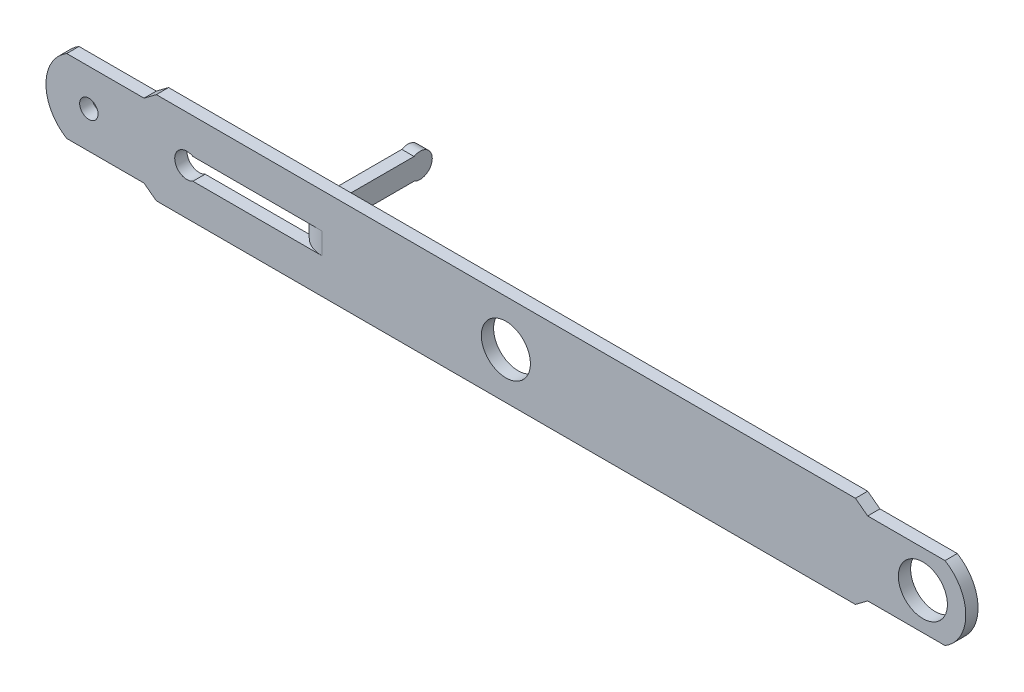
ISO-10303-21;
HEADER;
FILE_DESCRIPTION(('STEP AP214'),'2;1');
FILE_NAME('part.step','',(''),(''),'','','');
FILE_SCHEMA(('AUTOMOTIVE_DESIGN { 1 0 10303 214 1 1 1 1 }'));
ENDSEC;
DATA;
#1=APPLICATION_CONTEXT('core data for automotive mechanical design processes');
#2=APPLICATION_PROTOCOL_DEFINITION('international standard','automotive_design',2000,#1);
#3=PRODUCT_CONTEXT('',#1,'mechanical');
#4=PRODUCT('Part','Part','',(#3));
#5=PRODUCT_RELATED_PRODUCT_CATEGORY('part','',(#4));
#6=PRODUCT_DEFINITION_FORMATION('','',#4);
#7=PRODUCT_DEFINITION_CONTEXT('part definition',#1,'design');
#8=PRODUCT_DEFINITION('design','',#6,#7);
#9=PRODUCT_DEFINITION_SHAPE('','',#8);
#10=(LENGTH_UNIT() NAMED_UNIT(*) SI_UNIT(.MILLI.,.METRE.));
#11=(NAMED_UNIT(*) PLANE_ANGLE_UNIT() SI_UNIT($,.RADIAN.));
#12=(NAMED_UNIT(*) SI_UNIT($,.STERADIAN.) SOLID_ANGLE_UNIT());
#13=UNCERTAINTY_MEASURE_WITH_UNIT(LENGTH_MEASURE(1.E-05),#10,'distance_accuracy_value','');
#14=(GEOMETRIC_REPRESENTATION_CONTEXT(3) GLOBAL_UNCERTAINTY_ASSIGNED_CONTEXT((#13)) GLOBAL_UNIT_ASSIGNED_CONTEXT((#10,
#11,#12)) REPRESENTATION_CONTEXT('',''));
#15=CARTESIAN_POINT('',(0.,0.,0.));
#16=DIRECTION('',(0.,0.,1.));
#17=DIRECTION('',(1.,0.,0.));
#18=AXIS2_PLACEMENT_3D('',#15,#16,#17);
#19=CARTESIAN_POINT('',(-68.,0.,2.));
#20=DIRECTION('',(0.,0.,-1.));
#21=DIRECTION('',(-1.,0.,0.));
#22=AXIS2_PLACEMENT_3D('',#19,#20,#21);
#23=PLANE('',#22);
#24=DIRECTION('',(0.,-1.,0.));
#25=VECTOR('',#24,1.);
#26=CARTESIAN_POINT('',(-30.,0.,2.));
#27=LINE('',#26,#25);
#28=CARTESIAN_POINT('',(-30.,1.75,2.));
#29=VERTEX_POINT('',#28);
#30=CARTESIAN_POINT('',(-30.,-1.75,2.));
#31=VERTEX_POINT('',#30);
#32=EDGE_CURVE('E347',#29,#31,#27,.T.);
#33=ORIENTED_EDGE('',*,*,#32,.T.);
#34=DIRECTION('',(-1.,0.,0.));
#35=VECTOR('',#34,1.);
#36=CARTESIAN_POINT('',(-35.,-1.75,2.));
#37=LINE('',#36,#35);
#38=CARTESIAN_POINT('',(-51.0317541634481,-1.75,2.));
#39=VERTEX_POINT('',#38);
#40=EDGE_CURVE('E218',#31,#39,#37,.T.);
#41=ORIENTED_EDGE('',*,*,#40,.T.);
#42=CARTESIAN_POINT('',(-52.,0.,2.));
#43=DIRECTION('',(0.,0.,-1.));
#44=DIRECTION('',(-1.,0.,0.));
#45=AXIS2_PLACEMENT_3D('',#42,#43,#44);
#46=CIRCLE('',#45,2.);
#47=CARTESIAN_POINT('',(-51.0317541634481,1.75,2.));
#48=VERTEX_POINT('',#47);
#49=EDGE_CURVE('E221',#39,#48,#46,.T.);
#50=ORIENTED_EDGE('',*,*,#49,.T.);
#51=DIRECTION('',(1.,0.,0.));
#52=VECTOR('',#51,1.);
#53=CARTESIAN_POINT('',(-35.,1.75,2.));
#54=LINE('',#53,#52);
#55=EDGE_CURVE('E224',#48,#29,#54,.T.);
#56=ORIENTED_EDGE('',*,*,#55,.T.);
#57=EDGE_LOOP('',(#33,#41,#50,#56));
#58=FACE_BOUND('',#57,.T.);
#59=CARTESIAN_POINT('',(-68.,0.,2.));
#60=DIRECTION('',(0.,0.,1.));
#61=DIRECTION('',(1.,0.,0.));
#62=AXIS2_PLACEMENT_3D('',#59,#60,#61);
#63=CIRCLE('',#62,1.5);
#64=CARTESIAN_POINT('',(-66.5,0.,2.));
#65=VERTEX_POINT('',#64);
#66=EDGE_CURVE('E240',#65,#65,#63,.T.);
#67=ORIENTED_EDGE('',*,*,#66,.F.);
#68=EDGE_LOOP('',(#67));
#69=FACE_BOUND('',#68,.T.);
#70=DIRECTION('',(-1.,0.,0.));
#71=VECTOR('',#70,1.);
#72=CARTESIAN_POINT('',(57.,7.49999999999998,2.));
#73=LINE('',#72,#71);
#74=CARTESIAN_POINT('',(57.,7.49999999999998,2.));
#75=VERTEX_POINT('',#74);
#76=CARTESIAN_POINT('',(-57.,7.49999999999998,2.));
#77=VERTEX_POINT('',#76);
#78=EDGE_CURVE('E276',#75,#77,#73,.T.);
#79=ORIENTED_EDGE('',*,*,#78,.T.);
#80=DIRECTION('',(-0.800000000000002,-0.599999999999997,0.));
#81=VECTOR('',#80,1.);
#82=CARTESIAN_POINT('',(-59.,6.,2.));
#83=LINE('',#82,#81);
#84=CARTESIAN_POINT('',(-59.,6.,2.));
#85=VERTEX_POINT('',#84);
#86=EDGE_CURVE('E279',#77,#85,#83,.T.);
#87=ORIENTED_EDGE('',*,*,#86,.T.);
#88=DIRECTION('',(-1.,0.,0.));
#89=VECTOR('',#88,1.);
#90=CARTESIAN_POINT('',(-71.605551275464,5.99999999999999,2.));
#91=LINE('',#90,#89);
#92=CARTESIAN_POINT('',(-71.605551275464,5.99999999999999,2.));
#93=VERTEX_POINT('',#92);
#94=EDGE_CURVE('E281',#85,#93,#91,.T.);
#95=ORIENTED_EDGE('',*,*,#94,.T.);
#96=CARTESIAN_POINT('',(-68.,0.,2.));
#97=DIRECTION('',(0.,0.,1.));
#98=DIRECTION('',(-1.,0.,0.));
#99=AXIS2_PLACEMENT_3D('',#96,#97,#98);
#100=CIRCLE('',#99,7.);
#101=CARTESIAN_POINT('',(-71.605551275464,-5.99999999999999,2.));
#102=VERTEX_POINT('',#101);
#103=EDGE_CURVE('E283',#93,#102,#100,.T.);
#104=ORIENTED_EDGE('',*,*,#103,.T.);
#105=DIRECTION('',(1.,0.,0.));
#106=VECTOR('',#105,1.);
#107=CARTESIAN_POINT('',(-71.605551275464,-5.99999999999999,2.));
#108=LINE('',#107,#106);
#109=CARTESIAN_POINT('',(-59.,-6.,2.));
#110=VERTEX_POINT('',#109);
#111=EDGE_CURVE('E285',#102,#110,#108,.T.);
#112=ORIENTED_EDGE('',*,*,#111,.T.);
#113=DIRECTION('',(0.800000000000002,-0.599999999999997,0.));
#114=VECTOR('',#113,1.);
#115=CARTESIAN_POINT('',(-59.,-6.,2.));
#116=LINE('',#115,#114);
#117=CARTESIAN_POINT('',(-57.,-7.49999999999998,2.));
#118=VERTEX_POINT('',#117);
#119=EDGE_CURVE('E287',#110,#118,#116,.T.);
#120=ORIENTED_EDGE('',*,*,#119,.T.);
#121=DIRECTION('',(1.,0.,0.));
#122=VECTOR('',#121,1.);
#123=CARTESIAN_POINT('',(57.,-7.49999999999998,2.));
#124=LINE('',#123,#122);
#125=CARTESIAN_POINT('',(57.,-7.49999999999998,2.));
#126=VERTEX_POINT('',#125);
#127=EDGE_CURVE('E289',#118,#126,#124,.T.);
#128=ORIENTED_EDGE('',*,*,#127,.T.);
#129=DIRECTION('',(0.800000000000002,0.599999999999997,0.));
#130=VECTOR('',#129,1.);
#131=CARTESIAN_POINT('',(59.,-6.,2.));
#132=LINE('',#131,#130);
#133=CARTESIAN_POINT('',(59.,-6.,2.));
#134=VERTEX_POINT('',#133);
#135=EDGE_CURVE('E291',#126,#134,#132,.T.);
#136=ORIENTED_EDGE('',*,*,#135,.T.);
#137=DIRECTION('',(1.,0.,0.));
#138=VECTOR('',#137,1.);
#139=CARTESIAN_POINT('',(71.605551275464,-5.99999999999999,2.));
#140=LINE('',#139,#138);
#141=CARTESIAN_POINT('',(71.605551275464,-6.,2.));
#142=VERTEX_POINT('',#141);
#143=EDGE_CURVE('E293',#134,#142,#140,.T.);
#144=ORIENTED_EDGE('',*,*,#143,.T.);
#145=CARTESIAN_POINT('',(68.,0.,2.));
#146=DIRECTION('',(0.,0.,1.));
#147=DIRECTION('',(1.,0.,0.));
#148=AXIS2_PLACEMENT_3D('',#145,#146,#147);
#149=CIRCLE('',#148,7.);
#150=CARTESIAN_POINT('',(71.605551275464,5.99999999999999,2.));
#151=VERTEX_POINT('',#150);
#152=EDGE_CURVE('E295',#142,#151,#149,.T.);
#153=ORIENTED_EDGE('',*,*,#152,.T.);
#154=DIRECTION('',(-1.,0.,0.));
#155=VECTOR('',#154,1.);
#156=CARTESIAN_POINT('',(71.605551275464,5.99999999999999,2.));
#157=LINE('',#156,#155);
#158=CARTESIAN_POINT('',(59.,6.,2.));
#159=VERTEX_POINT('',#158);
#160=EDGE_CURVE('E297',#151,#159,#157,.T.);
#161=ORIENTED_EDGE('',*,*,#160,.T.);
#162=DIRECTION('',(-0.800000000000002,0.599999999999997,0.));
#163=VECTOR('',#162,1.);
#164=CARTESIAN_POINT('',(59.,6.,2.));
#165=LINE('',#164,#163);
#166=EDGE_CURVE('E299',#159,#75,#165,.T.);
#167=ORIENTED_EDGE('',*,*,#166,.T.);
#168=EDGE_LOOP('',(#79,#87,#95,#104,#112,#120,#128,#136,#144,#153,#161,#167));
#169=FACE_BOUND('',#168,.T.);
#170=CARTESIAN_POINT('',(68.,0.,2.));
#171=DIRECTION('',(0.,0.,1.));
#172=DIRECTION('',(1.,0.,0.));
#173=AXIS2_PLACEMENT_3D('',#170,#171,#172);
#174=CIRCLE('',#173,4.00000000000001);
#175=CARTESIAN_POINT('',(72.,0.,2.));
#176=VERTEX_POINT('',#175);
#177=EDGE_CURVE('E247',#176,#176,#174,.T.);
#178=ORIENTED_EDGE('',*,*,#177,.F.);
#179=EDGE_LOOP('',(#178));
#180=FACE_BOUND('',#179,.T.);
#181=CARTESIAN_POINT('',(0.,0.,2.));
#182=DIRECTION('',(0.,0.,1.));
#183=DIRECTION('',(1.,0.,0.));
#184=AXIS2_PLACEMENT_3D('',#181,#182,#183);
#185=CIRCLE('',#184,4.);
#186=CARTESIAN_POINT('',(4.,0.,2.));
#187=VERTEX_POINT('',#186);
#188=EDGE_CURVE('E234',#187,#187,#185,.T.);
#189=ORIENTED_EDGE('',*,*,#188,.F.);
#190=EDGE_LOOP('',(#189));
#191=FACE_BOUND('',#190,.T.);
#192=ADVANCED_FACE('F33',(#58,#69,#169,#180,#191),#23,.F.);
#193=CARTESIAN_POINT('',(-68.,0.,0.));
#194=DIRECTION('',(0.,0.,-1.));
#195=DIRECTION('',(-1.,0.,0.));
#196=AXIS2_PLACEMENT_3D('',#193,#194,#195);
#197=PLANE('',#196);
#198=DIRECTION('',(0.,1.,0.));
#199=VECTOR('',#198,1.);
#200=CARTESIAN_POINT('',(-30.,0.,0.));
#201=LINE('',#200,#199);
#202=CARTESIAN_POINT('',(-30.,-1.75,0.));
#203=VERTEX_POINT('',#202);
#204=CARTESIAN_POINT('',(-30.,1.75,0.));
#205=VERTEX_POINT('',#204);
#206=EDGE_CURVE('E337',#203,#205,#201,.T.);
#207=ORIENTED_EDGE('',*,*,#206,.T.);
#208=DIRECTION('',(1.,0.,0.));
#209=VECTOR('',#208,1.);
#210=CARTESIAN_POINT('',(-68.,1.75,0.));
#211=LINE('',#210,#209);
#212=CARTESIAN_POINT('',(-34.,1.75,0.));
#213=VERTEX_POINT('',#212);
#214=EDGE_CURVE('E207',#213,#205,#211,.T.);
#215=ORIENTED_EDGE('',*,*,#214,.F.);
#216=DIRECTION('',(1.,0.,0.));
#217=VECTOR('',#216,1.);
#218=CARTESIAN_POINT('',(-35.,1.75,0.));
#219=LINE('',#218,#217);
#220=CARTESIAN_POINT('',(-51.0317541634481,1.75,0.));
#221=VERTEX_POINT('',#220);
#222=EDGE_CURVE('E216',#221,#213,#219,.T.);
#223=ORIENTED_EDGE('',*,*,#222,.F.);
#224=CARTESIAN_POINT('',(-52.,0.,0.));
#225=DIRECTION('',(0.,0.,-1.));
#226=DIRECTION('',(-1.,0.,0.));
#227=AXIS2_PLACEMENT_3D('',#224,#225,#226);
#228=CIRCLE('',#227,2.);
#229=CARTESIAN_POINT('',(-51.0317541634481,-1.75,0.));
#230=VERTEX_POINT('',#229);
#231=EDGE_CURVE('E213',#230,#221,#228,.T.);
#232=ORIENTED_EDGE('',*,*,#231,.F.);
#233=DIRECTION('',(-1.,0.,0.));
#234=VECTOR('',#233,1.);
#235=CARTESIAN_POINT('',(-35.,-1.75,0.));
#236=LINE('',#235,#234);
#237=CARTESIAN_POINT('',(-34.,-1.75,0.));
#238=VERTEX_POINT('',#237);
#239=EDGE_CURVE('E48',#238,#230,#236,.T.);
#240=ORIENTED_EDGE('',*,*,#239,.F.);
#241=DIRECTION('',(-1.,0.,0.));
#242=VECTOR('',#241,1.);
#243=CARTESIAN_POINT('',(-68.,-1.75,0.));
#244=LINE('',#243,#242);
#245=EDGE_CURVE('E210',#203,#238,#244,.T.);
#246=ORIENTED_EDGE('',*,*,#245,.F.);
#247=EDGE_LOOP('',(#207,#215,#223,#232,#240,#246));
#248=FACE_BOUND('',#247,.T.);
#249=CARTESIAN_POINT('',(-68.,0.,0.));
#250=DIRECTION('',(0.,0.,1.));
#251=DIRECTION('',(1.,0.,0.));
#252=AXIS2_PLACEMENT_3D('',#249,#250,#251);
#253=CIRCLE('',#252,1.5);
#254=CARTESIAN_POINT('',(-66.5,0.,0.));
#255=VERTEX_POINT('',#254);
#256=EDGE_CURVE('E237',#255,#255,#253,.T.);
#257=ORIENTED_EDGE('',*,*,#256,.T.);
#258=EDGE_LOOP('',(#257));
#259=FACE_BOUND('',#258,.T.);
#260=DIRECTION('',(-1.,0.,0.));
#261=VECTOR('',#260,1.);
#262=CARTESIAN_POINT('',(57.,7.49999999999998,0.));
#263=LINE('',#262,#261);
#264=CARTESIAN_POINT('',(57.,7.49999999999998,0.));
#265=VERTEX_POINT('',#264);
#266=CARTESIAN_POINT('',(-57.,7.49999999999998,0.));
#267=VERTEX_POINT('',#266);
#268=EDGE_CURVE('E251',#265,#267,#263,.T.);
#269=ORIENTED_EDGE('',*,*,#268,.F.);
#270=DIRECTION('',(-0.800000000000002,0.599999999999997,0.));
#271=VECTOR('',#270,1.);
#272=CARTESIAN_POINT('',(59.,6.,0.));
#273=LINE('',#272,#271);
#274=CARTESIAN_POINT('',(59.,6.,0.));
#275=VERTEX_POINT('',#274);
#276=EDGE_CURVE('E274',#275,#265,#273,.T.);
#277=ORIENTED_EDGE('',*,*,#276,.F.);
#278=DIRECTION('',(-1.,0.,0.));
#279=VECTOR('',#278,1.);
#280=CARTESIAN_POINT('',(71.605551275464,5.99999999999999,0.));
#281=LINE('',#280,#279);
#282=CARTESIAN_POINT('',(71.605551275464,5.99999999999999,0.));
#283=VERTEX_POINT('',#282);
#284=EDGE_CURVE('E272',#283,#275,#281,.T.);
#285=ORIENTED_EDGE('',*,*,#284,.F.);
#286=CARTESIAN_POINT('',(68.,0.,0.));
#287=DIRECTION('',(0.,0.,1.));
#288=DIRECTION('',(1.,0.,0.));
#289=AXIS2_PLACEMENT_3D('',#286,#287,#288);
#290=CIRCLE('',#289,7.);
#291=CARTESIAN_POINT('',(71.605551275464,-6.,0.));
#292=VERTEX_POINT('',#291);
#293=EDGE_CURVE('E270',#292,#283,#290,.T.);
#294=ORIENTED_EDGE('',*,*,#293,.F.);
#295=DIRECTION('',(1.,0.,0.));
#296=VECTOR('',#295,1.);
#297=CARTESIAN_POINT('',(71.605551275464,-5.99999999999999,0.));
#298=LINE('',#297,#296);
#299=CARTESIAN_POINT('',(59.,-6.,0.));
#300=VERTEX_POINT('',#299);
#301=EDGE_CURVE('E268',#300,#292,#298,.T.);
#302=ORIENTED_EDGE('',*,*,#301,.F.);
#303=DIRECTION('',(0.800000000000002,0.599999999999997,0.));
#304=VECTOR('',#303,1.);
#305=CARTESIAN_POINT('',(59.,-6.,0.));
#306=LINE('',#305,#304);
#307=CARTESIAN_POINT('',(57.,-7.49999999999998,0.));
#308=VERTEX_POINT('',#307);
#309=EDGE_CURVE('E266',#308,#300,#306,.T.);
#310=ORIENTED_EDGE('',*,*,#309,.F.);
#311=DIRECTION('',(1.,0.,0.));
#312=VECTOR('',#311,1.);
#313=CARTESIAN_POINT('',(57.,-7.49999999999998,0.));
#314=LINE('',#313,#312);
#315=CARTESIAN_POINT('',(-57.,-7.49999999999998,0.));
#316=VERTEX_POINT('',#315);
#317=EDGE_CURVE('E264',#316,#308,#314,.T.);
#318=ORIENTED_EDGE('',*,*,#317,.F.);
#319=DIRECTION('',(0.800000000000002,-0.599999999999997,0.));
#320=VECTOR('',#319,1.);
#321=CARTESIAN_POINT('',(-59.,-6.,0.));
#322=LINE('',#321,#320);
#323=CARTESIAN_POINT('',(-59.,-6.,0.));
#324=VERTEX_POINT('',#323);
#325=EDGE_CURVE('E262',#324,#316,#322,.T.);
#326=ORIENTED_EDGE('',*,*,#325,.F.);
#327=DIRECTION('',(1.,0.,0.));
#328=VECTOR('',#327,1.);
#329=CARTESIAN_POINT('',(-71.605551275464,-5.99999999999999,0.));
#330=LINE('',#329,#328);
#331=CARTESIAN_POINT('',(-71.605551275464,-5.99999999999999,0.));
#332=VERTEX_POINT('',#331);
#333=EDGE_CURVE('E260',#332,#324,#330,.T.);
#334=ORIENTED_EDGE('',*,*,#333,.F.);
#335=CARTESIAN_POINT('',(-68.,0.,0.));
#336=DIRECTION('',(0.,0.,1.));
#337=DIRECTION('',(-1.,0.,0.));
#338=AXIS2_PLACEMENT_3D('',#335,#336,#337);
#339=CIRCLE('',#338,7.);
#340=CARTESIAN_POINT('',(-71.605551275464,5.99999999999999,0.));
#341=VERTEX_POINT('',#340);
#342=EDGE_CURVE('E258',#341,#332,#339,.T.);
#343=ORIENTED_EDGE('',*,*,#342,.F.);
#344=DIRECTION('',(-1.,0.,0.));
#345=VECTOR('',#344,1.);
#346=CARTESIAN_POINT('',(-71.605551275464,5.99999999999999,0.));
#347=LINE('',#346,#345);
#348=CARTESIAN_POINT('',(-59.,6.,0.));
#349=VERTEX_POINT('',#348);
#350=EDGE_CURVE('E256',#349,#341,#347,.T.);
#351=ORIENTED_EDGE('',*,*,#350,.F.);
#352=DIRECTION('',(-0.800000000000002,-0.599999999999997,0.));
#353=VECTOR('',#352,1.);
#354=CARTESIAN_POINT('',(-59.,6.,0.));
#355=LINE('',#354,#353);
#356=EDGE_CURVE('E254',#267,#349,#355,.T.);
#357=ORIENTED_EDGE('',*,*,#356,.F.);
#358=EDGE_LOOP('',(#269,#277,#285,#294,#302,#310,#318,#326,#334,#343,#351,#357));
#359=FACE_BOUND('',#358,.T.);
#360=CARTESIAN_POINT('',(68.,0.,0.));
#361=DIRECTION('',(0.,0.,1.));
#362=DIRECTION('',(1.,0.,0.));
#363=AXIS2_PLACEMENT_3D('',#360,#361,#362);
#364=CIRCLE('',#363,4.00000000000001);
#365=CARTESIAN_POINT('',(72.,0.,0.));
#366=VERTEX_POINT('',#365);
#367=EDGE_CURVE('E243',#366,#366,#364,.T.);
#368=ORIENTED_EDGE('',*,*,#367,.T.);
#369=EDGE_LOOP('',(#368));
#370=FACE_BOUND('',#369,.T.);
#371=CARTESIAN_POINT('',(0.,0.,0.));
#372=DIRECTION('',(0.,0.,1.));
#373=DIRECTION('',(1.,0.,0.));
#374=AXIS2_PLACEMENT_3D('',#371,#372,#373);
#375=CIRCLE('',#374,4.);
#376=CARTESIAN_POINT('',(4.,0.,0.));
#377=VERTEX_POINT('',#376);
#378=EDGE_CURVE('E229',#377,#377,#375,.T.);
#379=ORIENTED_EDGE('',*,*,#378,.T.);
#380=EDGE_LOOP('',(#379));
#381=FACE_BOUND('',#380,.T.);
#382=ADVANCED_FACE('F367',(#248,#259,#359,#370,#381),#197,.T.);
#383=CARTESIAN_POINT('',(57.,7.49999999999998,2.));
#384=DIRECTION('',(0.,-1.,0.));
#385=DIRECTION('',(0.,0.,-1.));
#386=AXIS2_PLACEMENT_3D('',#383,#384,#385);
#387=PLANE('',#386);
#388=ORIENTED_EDGE('',*,*,#268,.T.);
#389=DIRECTION('',(0.,0.,-1.));
#390=VECTOR('',#389,1.);
#391=CARTESIAN_POINT('',(-57.,7.49999999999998,2.));
#392=LINE('',#391,#390);
#393=EDGE_CURVE('E334',#77,#267,#392,.T.);
#394=ORIENTED_EDGE('',*,*,#393,.F.);
#395=ORIENTED_EDGE('',*,*,#78,.F.);
#396=DIRECTION('',(0.,0.,-1.));
#397=VECTOR('',#396,1.);
#398=CARTESIAN_POINT('',(57.,7.49999999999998,2.));
#399=LINE('',#398,#397);
#400=EDGE_CURVE('E301',#75,#265,#399,.T.);
#401=ORIENTED_EDGE('',*,*,#400,.T.);
#402=EDGE_LOOP('',(#388,#394,#395,#401));
#403=FACE_BOUND('',#402,.T.);
#404=ADVANCED_FACE('F35',(#403),#387,.F.);
#405=CARTESIAN_POINT('',(-59.,6.,2.));
#406=DIRECTION('',(0.599999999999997,-0.800000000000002,0.));
#407=DIRECTION('',(0.800000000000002,0.599999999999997,0.));
#408=AXIS2_PLACEMENT_3D('',#405,#406,#407);
#409=PLANE('',#408);
#410=ORIENTED_EDGE('',*,*,#356,.T.);
#411=DIRECTION('',(0.,0.,-1.));
#412=VECTOR('',#411,1.);
#413=CARTESIAN_POINT('',(-59.,6.,2.));
#414=LINE('',#413,#412);
#415=EDGE_CURVE('E331',#85,#349,#414,.T.);
#416=ORIENTED_EDGE('',*,*,#415,.F.);
#417=ORIENTED_EDGE('',*,*,#86,.F.);
#418=ORIENTED_EDGE('',*,*,#393,.T.);
#419=EDGE_LOOP('',(#410,#416,#417,#418));
#420=FACE_BOUND('',#419,.T.);
#421=ADVANCED_FACE('F437',(#420),#409,.F.);
#422=CARTESIAN_POINT('',(-71.605551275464,5.99999999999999,2.));
#423=DIRECTION('',(0.,-1.,0.));
#424=DIRECTION('',(1.,0.,0.));
#425=AXIS2_PLACEMENT_3D('',#422,#423,#424);
#426=PLANE('',#425);
#427=ORIENTED_EDGE('',*,*,#350,.T.);
#428=DIRECTION('',(0.,0.,-1.));
#429=VECTOR('',#428,1.);
#430=CARTESIAN_POINT('',(-71.605551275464,5.99999999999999,2.));
#431=LINE('',#430,#429);
#432=EDGE_CURVE('E328',#93,#341,#431,.T.);
#433=ORIENTED_EDGE('',*,*,#432,.F.);
#434=ORIENTED_EDGE('',*,*,#94,.F.);
#435=ORIENTED_EDGE('',*,*,#415,.T.);
#436=EDGE_LOOP('',(#427,#433,#434,#435));
#437=FACE_BOUND('',#436,.T.);
#438=ADVANCED_FACE('F434',(#437),#426,.F.);
#439=CARTESIAN_POINT('',(-68.,0.,2.));
#440=DIRECTION('',(0.,0.,-1.));
#441=DIRECTION('',(-1.,0.,0.));
#442=AXIS2_PLACEMENT_3D('',#439,#440,#441);
#443=CYLINDRICAL_SURFACE('',#442,7.);
#444=ORIENTED_EDGE('',*,*,#342,.T.);
#445=DIRECTION('',(0.,0.,-1.));
#446=VECTOR('',#445,1.);
#447=CARTESIAN_POINT('',(-71.605551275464,-5.99999999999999,2.));
#448=LINE('',#447,#446);
#449=EDGE_CURVE('E325',#102,#332,#448,.T.);
#450=ORIENTED_EDGE('',*,*,#449,.F.);
#451=ORIENTED_EDGE('',*,*,#103,.F.);
#452=ORIENTED_EDGE('',*,*,#432,.T.);
#453=EDGE_LOOP('',(#444,#450,#451,#452));
#454=FACE_BOUND('',#453,.T.);
#455=ADVANCED_FACE('F430',(#454),#443,.T.);
#456=CARTESIAN_POINT('',(-71.605551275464,-5.99999999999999,2.));
#457=DIRECTION('',(0.,1.,0.));
#458=DIRECTION('',(-1.,0.,0.));
#459=AXIS2_PLACEMENT_3D('',#456,#457,#458);
#460=PLANE('',#459);
#461=ORIENTED_EDGE('',*,*,#333,.T.);
#462=DIRECTION('',(0.,0.,-1.));
#463=VECTOR('',#462,1.);
#464=CARTESIAN_POINT('',(-59.,-6.,2.));
#465=LINE('',#464,#463);
#466=EDGE_CURVE('E322',#110,#324,#465,.T.);
#467=ORIENTED_EDGE('',*,*,#466,.F.);
#468=ORIENTED_EDGE('',*,*,#111,.F.);
#469=ORIENTED_EDGE('',*,*,#449,.T.);
#470=EDGE_LOOP('',(#461,#467,#468,#469));
#471=FACE_BOUND('',#470,.T.);
#472=ADVANCED_FACE('F426',(#471),#460,.F.);
#473=CARTESIAN_POINT('',(-59.,-6.,2.));
#474=DIRECTION('',(0.599999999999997,0.800000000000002,0.));
#475=DIRECTION('',(-0.800000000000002,0.599999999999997,0.));
#476=AXIS2_PLACEMENT_3D('',#473,#474,#475);
#477=PLANE('',#476);
#478=ORIENTED_EDGE('',*,*,#325,.T.);
#479=DIRECTION('',(0.,0.,-1.));
#480=VECTOR('',#479,1.);
#481=CARTESIAN_POINT('',(-57.,-7.49999999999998,2.));
#482=LINE('',#481,#480);
#483=EDGE_CURVE('E319',#118,#316,#482,.T.);
#484=ORIENTED_EDGE('',*,*,#483,.F.);
#485=ORIENTED_EDGE('',*,*,#119,.F.);
#486=ORIENTED_EDGE('',*,*,#466,.T.);
#487=EDGE_LOOP('',(#478,#484,#485,#486));
#488=FACE_BOUND('',#487,.T.);
#489=ADVANCED_FACE('F422',(#488),#477,.F.);
#490=CARTESIAN_POINT('',(57.,-7.49999999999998,2.));
#491=DIRECTION('',(0.,1.,0.));
#492=DIRECTION('',(0.,0.,1.));
#493=AXIS2_PLACEMENT_3D('',#490,#491,#492);
#494=PLANE('',#493);
#495=ORIENTED_EDGE('',*,*,#317,.T.);
#496=DIRECTION('',(0.,0.,-1.));
#497=VECTOR('',#496,1.);
#498=CARTESIAN_POINT('',(57.,-7.49999999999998,2.));
#499=LINE('',#498,#497);
#500=EDGE_CURVE('E316',#126,#308,#499,.T.);
#501=ORIENTED_EDGE('',*,*,#500,.F.);
#502=ORIENTED_EDGE('',*,*,#127,.F.);
#503=ORIENTED_EDGE('',*,*,#483,.T.);
#504=EDGE_LOOP('',(#495,#501,#502,#503));
#505=FACE_BOUND('',#504,.T.);
#506=ADVANCED_FACE('F418',(#505),#494,.F.);
#507=CARTESIAN_POINT('',(59.,-6.,2.));
#508=DIRECTION('',(-0.599999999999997,0.800000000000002,0.));
#509=DIRECTION('',(-0.800000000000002,-0.599999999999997,0.));
#510=AXIS2_PLACEMENT_3D('',#507,#508,#509);
#511=PLANE('',#510);
#512=ORIENTED_EDGE('',*,*,#309,.T.);
#513=DIRECTION('',(0.,0.,-1.));
#514=VECTOR('',#513,1.);
#515=CARTESIAN_POINT('',(59.,-6.,2.));
#516=LINE('',#515,#514);
#517=EDGE_CURVE('E313',#134,#300,#516,.T.);
#518=ORIENTED_EDGE('',*,*,#517,.F.);
#519=ORIENTED_EDGE('',*,*,#135,.F.);
#520=ORIENTED_EDGE('',*,*,#500,.T.);
#521=EDGE_LOOP('',(#512,#518,#519,#520));
#522=FACE_BOUND('',#521,.T.);
#523=ADVANCED_FACE('F414',(#522),#511,.F.);
#524=CARTESIAN_POINT('',(71.605551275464,-5.99999999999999,2.));
#525=DIRECTION('',(0.,1.,0.));
#526=DIRECTION('',(-1.,0.,0.));
#527=AXIS2_PLACEMENT_3D('',#524,#525,#526);
#528=PLANE('',#527);
#529=ORIENTED_EDGE('',*,*,#301,.T.);
#530=DIRECTION('',(0.,0.,-1.));
#531=VECTOR('',#530,1.);
#532=CARTESIAN_POINT('',(71.605551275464,-6.,2.));
#533=LINE('',#532,#531);
#534=EDGE_CURVE('E310',#142,#292,#533,.T.);
#535=ORIENTED_EDGE('',*,*,#534,.F.);
#536=ORIENTED_EDGE('',*,*,#143,.F.);
#537=ORIENTED_EDGE('',*,*,#517,.T.);
#538=EDGE_LOOP('',(#529,#535,#536,#537));
#539=FACE_BOUND('',#538,.T.);
#540=ADVANCED_FACE('F410',(#539),#528,.F.);
#541=CARTESIAN_POINT('',(68.,0.,2.));
#542=DIRECTION('',(0.,0.,-1.));
#543=DIRECTION('',(-1.,0.,0.));
#544=AXIS2_PLACEMENT_3D('',#541,#542,#543);
#545=CYLINDRICAL_SURFACE('',#544,7.);
#546=ORIENTED_EDGE('',*,*,#293,.T.);
#547=DIRECTION('',(0.,0.,-1.));
#548=VECTOR('',#547,1.);
#549=CARTESIAN_POINT('',(71.605551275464,5.99999999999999,2.));
#550=LINE('',#549,#548);
#551=EDGE_CURVE('E307',#151,#283,#550,.T.);
#552=ORIENTED_EDGE('',*,*,#551,.F.);
#553=ORIENTED_EDGE('',*,*,#152,.F.);
#554=ORIENTED_EDGE('',*,*,#534,.T.);
#555=EDGE_LOOP('',(#546,#552,#553,#554));
#556=FACE_BOUND('',#555,.T.);
#557=ADVANCED_FACE('F406',(#556),#545,.T.);
#558=CARTESIAN_POINT('',(71.605551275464,5.99999999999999,2.));
#559=DIRECTION('',(0.,-1.,0.));
#560=DIRECTION('',(1.,0.,0.));
#561=AXIS2_PLACEMENT_3D('',#558,#559,#560);
#562=PLANE('',#561);
#563=ORIENTED_EDGE('',*,*,#284,.T.);
#564=DIRECTION('',(0.,0.,-1.));
#565=VECTOR('',#564,1.);
#566=CARTESIAN_POINT('',(59.,6.,2.));
#567=LINE('',#566,#565);
#568=EDGE_CURVE('E304',#159,#275,#567,.T.);
#569=ORIENTED_EDGE('',*,*,#568,.F.);
#570=ORIENTED_EDGE('',*,*,#160,.F.);
#571=ORIENTED_EDGE('',*,*,#551,.T.);
#572=EDGE_LOOP('',(#563,#569,#570,#571));
#573=FACE_BOUND('',#572,.T.);
#574=ADVANCED_FACE('F402',(#573),#562,.F.);
#575=CARTESIAN_POINT('',(59.,6.,2.));
#576=DIRECTION('',(-0.599999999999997,-0.800000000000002,0.));
#577=DIRECTION('',(0.800000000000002,-0.599999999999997,0.));
#578=AXIS2_PLACEMENT_3D('',#575,#576,#577);
#579=PLANE('',#578);
#580=ORIENTED_EDGE('',*,*,#276,.T.);
#581=ORIENTED_EDGE('',*,*,#400,.F.);
#582=ORIENTED_EDGE('',*,*,#166,.F.);
#583=ORIENTED_EDGE('',*,*,#568,.T.);
#584=EDGE_LOOP('',(#580,#581,#582,#583));
#585=FACE_BOUND('',#584,.T.);
#586=ADVANCED_FACE('F398',(#585),#579,.F.);
#587=CARTESIAN_POINT('',(68.,0.,2.));
#588=DIRECTION('',(0.,0.,-1.));
#589=DIRECTION('',(-1.,0.,0.));
#590=AXIS2_PLACEMENT_3D('',#587,#588,#589);
#591=CYLINDRICAL_SURFACE('',#590,4.00000000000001);
#592=ORIENTED_EDGE('',*,*,#177,.T.);
#593=EDGE_LOOP('',(#592));
#594=FACE_BOUND('',#593,.T.);
#595=ORIENTED_EDGE('',*,*,#367,.F.);
#596=EDGE_LOOP('',(#595));
#597=FACE_BOUND('',#596,.T.);
#598=ADVANCED_FACE('F401',(#594,#597),#591,.F.);
#599=CARTESIAN_POINT('',(-68.,0.,2.));
#600=DIRECTION('',(0.,0.,-1.));
#601=DIRECTION('',(-1.,0.,0.));
#602=AXIS2_PLACEMENT_3D('',#599,#600,#601);
#603=CYLINDRICAL_SURFACE('',#602,1.5);
#604=ORIENTED_EDGE('',*,*,#66,.T.);
#605=EDGE_LOOP('',(#604));
#606=FACE_BOUND('',#605,.T.);
#607=ORIENTED_EDGE('',*,*,#256,.F.);
#608=EDGE_LOOP('',(#607));
#609=FACE_BOUND('',#608,.T.);
#610=ADVANCED_FACE('F490',(#606,#609),#603,.F.);
#611=CARTESIAN_POINT('',(0.,0.,2.));
#612=DIRECTION('',(0.,0.,-1.));
#613=DIRECTION('',(-1.,0.,0.));
#614=AXIS2_PLACEMENT_3D('',#611,#612,#613);
#615=CYLINDRICAL_SURFACE('',#614,4.);
#616=ORIENTED_EDGE('',*,*,#188,.T.);
#617=EDGE_LOOP('',(#616));
#618=FACE_BOUND('',#617,.T.);
#619=ORIENTED_EDGE('',*,*,#378,.F.);
#620=EDGE_LOOP('',(#619));
#621=FACE_BOUND('',#620,.T.);
#622=ADVANCED_FACE('F487',(#618,#621),#615,.F.);
#623=CARTESIAN_POINT('',(-35.,1.75,2.));
#624=DIRECTION('',(1.,0.,0.));
#625=DIRECTION('',(0.,0.,-1.));
#626=AXIS2_PLACEMENT_3D('',#623,#624,#625);
#627=PLANE('',#626);
#628=DIRECTION('',(0.,0.,1.));
#629=VECTOR('',#628,1.);
#630=CARTESIAN_POINT('',(-35.,-1.75,2.));
#631=LINE('',#630,#629);
#632=CARTESIAN_POINT('',(-35.,-1.75,-16.0317541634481));
#633=VERTEX_POINT('',#632);
#634=CARTESIAN_POINT('',(-35.,-1.75,-3.));
#635=VERTEX_POINT('',#634);
#636=EDGE_CURVE('E198',#633,#635,#631,.T.);
#637=ORIENTED_EDGE('',*,*,#636,.T.);
#638=DIRECTION('',(0.,-1.,0.));
#639=VECTOR('',#638,1.);
#640=CARTESIAN_POINT('',(-35.,1.75,-3.));
#641=LINE('',#640,#639);
#642=CARTESIAN_POINT('',(-35.,1.75,-3.));
#643=VERTEX_POINT('',#642);
#644=EDGE_CURVE('E181',#635,#643,#641,.F.);
#645=ORIENTED_EDGE('',*,*,#644,.T.);
#646=DIRECTION('',(0.,0.,-1.));
#647=VECTOR('',#646,1.);
#648=CARTESIAN_POINT('',(-35.,1.75,2.));
#649=LINE('',#648,#647);
#650=CARTESIAN_POINT('',(-35.,1.75,-16.0317541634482));
#651=VERTEX_POINT('',#650);
#652=EDGE_CURVE('E173',#643,#651,#649,.T.);
#653=ORIENTED_EDGE('',*,*,#652,.T.);
#654=CARTESIAN_POINT('',(-35.,0.,-17.));
#655=DIRECTION('',(-1.,0.,0.));
#656=DIRECTION('',(0.,0.,1.));
#657=AXIS2_PLACEMENT_3D('',#654,#655,#656);
#658=CIRCLE('',#657,2.);
#659=EDGE_CURVE('E178',#651,#633,#658,.T.);
#660=ORIENTED_EDGE('',*,*,#659,.T.);
#661=EDGE_LOOP('',(#637,#645,#653,#660));
#662=FACE_BOUND('',#661,.T.);
#663=ADVANCED_FACE('F176',(#662),#627,.F.);
#664=CARTESIAN_POINT('',(-35.,1.75,2.));
#665=DIRECTION('',(0.,1.,0.));
#666=DIRECTION('',(0.,0.,1.));
#667=AXIS2_PLACEMENT_3D('',#664,#665,#666);
#668=PLANE('',#667);
#669=ORIENTED_EDGE('',*,*,#222,.T.);
#670=CARTESIAN_POINT('',(-30.,1.75,-3.));
#671=DIRECTION('',(0.,1.,0.));
#672=DIRECTION('',(0.,0.,1.));
#673=AXIS2_PLACEMENT_3D('',#670,#671,#672);
#674=CIRCLE('',#673,5.);
#675=EDGE_CURVE('E11',#213,#29,#674,.T.);
#676=ORIENTED_EDGE('',*,*,#675,.T.);
#677=ORIENTED_EDGE('',*,*,#55,.F.);
#678=DIRECTION('',(0.,0.,-1.));
#679=VECTOR('',#678,1.);
#680=CARTESIAN_POINT('',(-51.0317541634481,1.75,2.));
#681=LINE('',#680,#679);
#682=EDGE_CURVE('E227',#48,#221,#681,.T.);
#683=ORIENTED_EDGE('',*,*,#682,.T.);
#684=EDGE_LOOP('',(#669,#676,#677,#683));
#685=FACE_BOUND('',#684,.T.);
#686=ADVANCED_FACE('F498',(#685),#668,.F.);
#687=CARTESIAN_POINT('',(-52.,0.,2.));
#688=DIRECTION('',(0.,0.,-1.));
#689=DIRECTION('',(-1.,0.,0.));
#690=AXIS2_PLACEMENT_3D('',#687,#688,#689);
#691=CYLINDRICAL_SURFACE('',#690,2.);
#692=ORIENTED_EDGE('',*,*,#231,.T.);
#693=ORIENTED_EDGE('',*,*,#682,.F.);
#694=ORIENTED_EDGE('',*,*,#49,.F.);
#695=DIRECTION('',(0.,0.,-1.));
#696=VECTOR('',#695,1.);
#697=CARTESIAN_POINT('',(-51.0317541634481,-1.75,2.));
#698=LINE('',#697,#696);
#699=EDGE_CURVE('E226',#39,#230,#698,.T.);
#700=ORIENTED_EDGE('',*,*,#699,.T.);
#701=EDGE_LOOP('',(#692,#693,#694,#700));
#702=FACE_BOUND('',#701,.T.);
#703=ADVANCED_FACE('F534',(#702),#691,.F.);
#704=CARTESIAN_POINT('',(-35.,-1.75,2.));
#705=DIRECTION('',(0.,-1.,0.));
#706=DIRECTION('',(0.,0.,-1.));
#707=AXIS2_PLACEMENT_3D('',#704,#705,#706);
#708=PLANE('',#707);
#709=ORIENTED_EDGE('',*,*,#239,.T.);
#710=ORIENTED_EDGE('',*,*,#699,.F.);
#711=ORIENTED_EDGE('',*,*,#40,.F.);
#712=CARTESIAN_POINT('',(-30.,-1.75,-3.));
#713=DIRECTION('',(0.,-1.,0.));
#714=DIRECTION('',(0.,0.,-1.));
#715=AXIS2_PLACEMENT_3D('',#712,#713,#714);
#716=CIRCLE('',#715,5.);
#717=EDGE_CURVE('E42',#31,#238,#716,.T.);
#718=ORIENTED_EDGE('',*,*,#717,.T.);
#719=EDGE_LOOP('',(#709,#710,#711,#718));
#720=FACE_BOUND('',#719,.T.);
#721=ADVANCED_FACE('F358',(#720),#708,.F.);
#722=CARTESIAN_POINT('',(-33.,-1.75,2.));
#723=DIRECTION('',(0.,-1.,0.));
#724=DIRECTION('',(0.,0.,-1.));
#725=AXIS2_PLACEMENT_3D('',#722,#723,#724);
#726=PLANE('',#725);
#727=ORIENTED_EDGE('',*,*,#245,.T.);
#728=CARTESIAN_POINT('',(-30.,-1.75,-3.));
#729=DIRECTION('',(0.,-1.,0.));
#730=DIRECTION('',(0.,0.,-1.));
#731=AXIS2_PLACEMENT_3D('',#728,#729,#730);
#732=CIRCLE('',#731,5.);
#733=EDGE_CURVE('E350',#238,#635,#732,.T.);
#734=ORIENTED_EDGE('',*,*,#733,.T.);
#735=ORIENTED_EDGE('',*,*,#636,.F.);
#736=DIRECTION('',(-1.,0.,0.));
#737=VECTOR('',#736,1.);
#738=CARTESIAN_POINT('',(-33.,-1.75,-16.0317541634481));
#739=LINE('',#738,#737);
#740=CARTESIAN_POINT('',(-33.,-1.75,-16.0317541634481));
#741=VERTEX_POINT('',#740);
#742=EDGE_CURVE('E194',#741,#633,#739,.T.);
#743=ORIENTED_EDGE('',*,*,#742,.F.);
#744=DIRECTION('',(0.,0.,1.));
#745=VECTOR('',#744,1.);
#746=CARTESIAN_POINT('',(-33.,-1.75,2.));
#747=LINE('',#746,#745);
#748=CARTESIAN_POINT('',(-33.,-1.75,-3.));
#749=VERTEX_POINT('',#748);
#750=EDGE_CURVE('E195',#741,#749,#747,.T.);
#751=ORIENTED_EDGE('',*,*,#750,.T.);
#752=CARTESIAN_POINT('',(-30.,-1.75,-3.));
#753=DIRECTION('',(0.,-1.,0.));
#754=DIRECTION('',(0.,0.,-1.));
#755=AXIS2_PLACEMENT_3D('',#752,#753,#754);
#756=CIRCLE('',#755,3.);
#757=EDGE_CURVE('E344',#749,#203,#756,.F.);
#758=ORIENTED_EDGE('',*,*,#757,.T.);
#759=EDGE_LOOP('',(#727,#734,#735,#743,#751,#758));
#760=FACE_BOUND('',#759,.T.);
#761=ADVANCED_FACE('F364',(#760),#726,.T.);
#762=CARTESIAN_POINT('',(-33.,0.,-17.));
#763=DIRECTION('',(-1.,0.,0.));
#764=DIRECTION('',(0.,0.,1.));
#765=AXIS2_PLACEMENT_3D('',#762,#763,#764);
#766=CYLINDRICAL_SURFACE('',#765,2.);
#767=ORIENTED_EDGE('',*,*,#659,.F.);
#768=DIRECTION('',(-1.,0.,0.));
#769=VECTOR('',#768,1.);
#770=CARTESIAN_POINT('',(-33.,1.75,-16.0317541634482));
#771=LINE('',#770,#769);
#772=CARTESIAN_POINT('',(-33.,1.75,-16.0317541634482));
#773=VERTEX_POINT('',#772);
#774=EDGE_CURVE('E187',#773,#651,#771,.T.);
#775=ORIENTED_EDGE('',*,*,#774,.F.);
#776=CARTESIAN_POINT('',(-33.,0.,-17.));
#777=DIRECTION('',(-1.,0.,0.));
#778=DIRECTION('',(0.,0.,1.));
#779=AXIS2_PLACEMENT_3D('',#776,#777,#778);
#780=CIRCLE('',#779,2.);
#781=EDGE_CURVE('E203',#773,#741,#780,.T.);
#782=ORIENTED_EDGE('',*,*,#781,.T.);
#783=ORIENTED_EDGE('',*,*,#742,.T.);
#784=EDGE_LOOP('',(#767,#775,#782,#783));
#785=FACE_BOUND('',#784,.T.);
#786=ADVANCED_FACE('F197',(#785),#766,.T.);
#787=CARTESIAN_POINT('',(-33.,1.75,2.));
#788=DIRECTION('',(0.,1.,0.));
#789=DIRECTION('',(0.,0.,1.));
#790=AXIS2_PLACEMENT_3D('',#787,#788,#789);
#791=PLANE('',#790);
#792=ORIENTED_EDGE('',*,*,#652,.F.);
#793=CARTESIAN_POINT('',(-30.,1.75,-3.));
#794=DIRECTION('',(0.,1.,0.));
#795=DIRECTION('',(0.,0.,1.));
#796=AXIS2_PLACEMENT_3D('',#793,#794,#795);
#797=CIRCLE('',#796,5.);
#798=EDGE_CURVE('E353',#643,#213,#797,.T.);
#799=ORIENTED_EDGE('',*,*,#798,.T.);
#800=ORIENTED_EDGE('',*,*,#214,.T.);
#801=CARTESIAN_POINT('',(-30.,1.75,-3.));
#802=DIRECTION('',(0.,1.,0.));
#803=DIRECTION('',(0.,0.,1.));
#804=AXIS2_PLACEMENT_3D('',#801,#802,#803);
#805=CIRCLE('',#804,3.);
#806=CARTESIAN_POINT('',(-33.,1.75,-3.));
#807=VERTEX_POINT('',#806);
#808=EDGE_CURVE('E342',#205,#807,#805,.F.);
#809=ORIENTED_EDGE('',*,*,#808,.T.);
#810=DIRECTION('',(0.,0.,-1.));
#811=VECTOR('',#810,1.);
#812=CARTESIAN_POINT('',(-33.,1.75,2.));
#813=LINE('',#812,#811);
#814=EDGE_CURVE('E190',#807,#773,#813,.T.);
#815=ORIENTED_EDGE('',*,*,#814,.T.);
#816=ORIENTED_EDGE('',*,*,#774,.T.);
#817=EDGE_LOOP('',(#792,#799,#800,#809,#815,#816));
#818=FACE_BOUND('',#817,.T.);
#819=ADVANCED_FACE('F188',(#818),#791,.T.);
#820=CARTESIAN_POINT('',(-33.,0.,-17.));
#821=DIRECTION('',(-1.,0.,0.));
#822=DIRECTION('',(0.,0.,1.));
#823=AXIS2_PLACEMENT_3D('',#820,#821,#822);
#824=PLANE('',#823);
#825=ORIENTED_EDGE('',*,*,#814,.F.);
#826=DIRECTION('',(0.,1.,0.));
#827=VECTOR('',#826,1.);
#828=CARTESIAN_POINT('',(-33.,0.,-3.));
#829=LINE('',#828,#827);
#830=EDGE_CURVE('E340',#807,#749,#829,.F.);
#831=ORIENTED_EDGE('',*,*,#830,.T.);
#832=ORIENTED_EDGE('',*,*,#750,.F.);
#833=ORIENTED_EDGE('',*,*,#781,.F.);
#834=EDGE_LOOP('',(#825,#831,#832,#833));
#835=FACE_BOUND('',#834,.T.);
#836=ADVANCED_FACE('F377',(#835),#824,.F.);
#837=CARTESIAN_POINT('',(-30.,0.,-3.));
#838=DIRECTION('',(0.,1.,0.));
#839=DIRECTION('',(0.,0.,1.));
#840=AXIS2_PLACEMENT_3D('',#837,#838,#839);
#841=CYLINDRICAL_SURFACE('',#840,3.);
#842=ORIENTED_EDGE('',*,*,#757,.F.);
#843=ORIENTED_EDGE('',*,*,#830,.F.);
#844=ORIENTED_EDGE('',*,*,#808,.F.);
#845=ORIENTED_EDGE('',*,*,#206,.F.);
#846=EDGE_LOOP('',(#842,#843,#844,#845));
#847=FACE_BOUND('',#846,.T.);
#848=ADVANCED_FACE('F374',(#847),#841,.F.);
#849=CARTESIAN_POINT('',(-30.,0.,-3.));
#850=DIRECTION('',(0.,-1.,0.));
#851=DIRECTION('',(0.,0.,-1.));
#852=AXIS2_PLACEMENT_3D('',#849,#850,#851);
#853=CYLINDRICAL_SURFACE('',#852,5.);
#854=ORIENTED_EDGE('',*,*,#798,.F.);
#855=ORIENTED_EDGE('',*,*,#644,.F.);
#856=ORIENTED_EDGE('',*,*,#733,.F.);
#857=ORIENTED_EDGE('',*,*,#717,.F.);
#858=ORIENTED_EDGE('',*,*,#32,.F.);
#859=ORIENTED_EDGE('',*,*,#675,.F.);
#860=EDGE_LOOP('',(#854,#855,#856,#857,#858,#859));
#861=FACE_BOUND('',#860,.T.);
#862=ADVANCED_FACE('F362',(#861),#853,.T.);
#863=CLOSED_SHELL('',(#192,#382,#404,#421,#438,#455,#472,#489,#506,#523,#540,#557,#574,#586,
#598,#610,#622,#663,#686,#703,#721,#761,#786,#819,#836,#848,#862));
#864=MANIFOLD_SOLID_BREP('B2',#863);
#865=ADVANCED_BREP_SHAPE_REPRESENTATION('',(#18,#864),#14);
#866=SHAPE_DEFINITION_REPRESENTATION(#9,#865);
ENDSEC;
END-ISO-10303-21;
